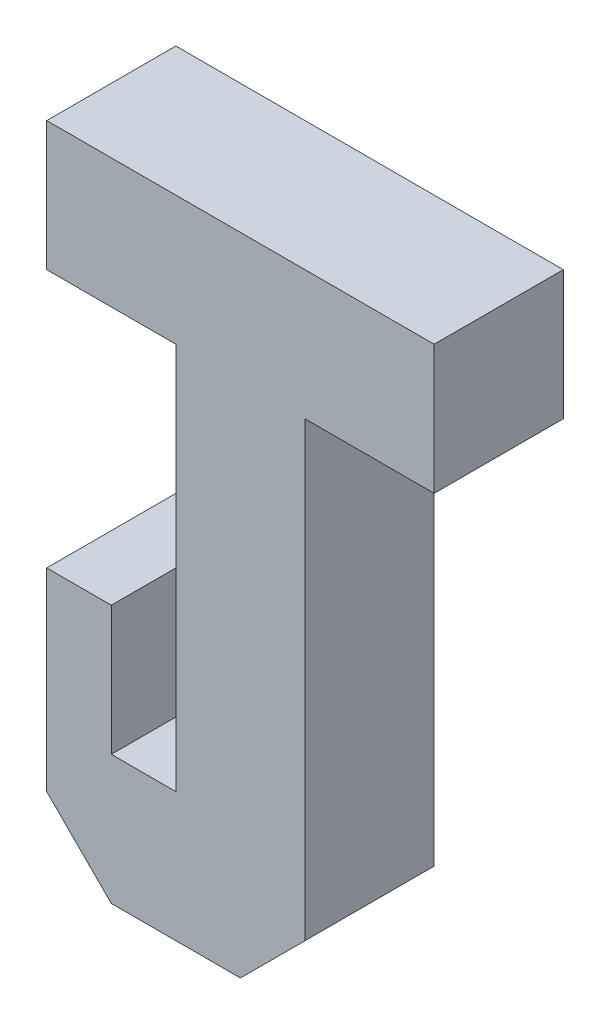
from build123d import *

# Parameters (mm, degrees)
BOSS_EXTRU_1_DEPTH = 10
CHANFREIN1_SIZE    = 5


with BuildPart() as part:
    # Esquisse1 → Boss.-Extru.1 (new body)
    with BuildSketch(Plane.XY):
        Polygon((10, 40), (20, 40), (20, 50), (-10, 50), (-10, 40), (0, 40), (0, 10), (-5, 10), (-5, 20), (-10, 20), (-10, 10), (-10, 0), (0, 0), (10, 0), align=None)
    extrude(amount=BOSS_EXTRU_1_DEPTH)

    # Chanfrein1
    chanfrein1_edges = [part.edges().sort_by_distance(p)[0] for p in [
        (10, 0, 5),
        (-10, 0, 5),
    ]]
    chamfer(chanfrein1_edges, length=CHANFREIN1_SIZE)


solid = part.part
